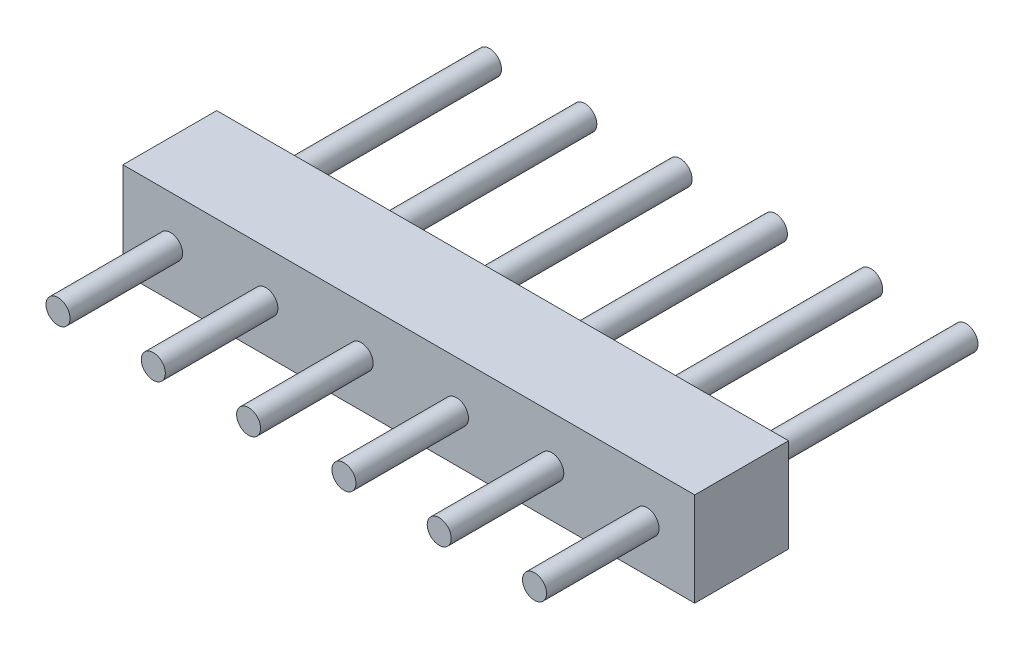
ISO-10303-21;
HEADER;
FILE_DESCRIPTION(('STEP AP214'),'2;1');
FILE_NAME('part.step','',(''),(''),'','','');
FILE_SCHEMA(('AUTOMOTIVE_DESIGN { 1 0 10303 214 1 1 1 1 }'));
ENDSEC;
DATA;
#1=APPLICATION_CONTEXT('core data for automotive mechanical design processes');
#2=APPLICATION_PROTOCOL_DEFINITION('international standard','automotive_design',2000,#1);
#3=PRODUCT_CONTEXT('',#1,'mechanical');
#4=PRODUCT('Part','Part','',(#3));
#5=PRODUCT_RELATED_PRODUCT_CATEGORY('part','',(#4));
#6=PRODUCT_DEFINITION_FORMATION('','',#4);
#7=PRODUCT_DEFINITION_CONTEXT('part definition',#1,'design');
#8=PRODUCT_DEFINITION('design','',#6,#7);
#9=PRODUCT_DEFINITION_SHAPE('','',#8);
#10=(LENGTH_UNIT() NAMED_UNIT(*) SI_UNIT(.MILLI.,.METRE.));
#11=(NAMED_UNIT(*) PLANE_ANGLE_UNIT() SI_UNIT($,.RADIAN.));
#12=(NAMED_UNIT(*) SI_UNIT($,.STERADIAN.) SOLID_ANGLE_UNIT());
#13=UNCERTAINTY_MEASURE_WITH_UNIT(LENGTH_MEASURE(1.E-05),#10,'distance_accuracy_value','');
#14=(GEOMETRIC_REPRESENTATION_CONTEXT(3) GLOBAL_UNCERTAINTY_ASSIGNED_CONTEXT((#13)) GLOBAL_UNIT_ASSIGNED_CONTEXT((#10,
#11,#12)) REPRESENTATION_CONTEXT('',''));
#15=CARTESIAN_POINT('',(0.,0.,0.));
#16=DIRECTION('',(0.,0.,1.));
#17=DIRECTION('',(1.,0.,0.));
#18=AXIS2_PLACEMENT_3D('',#15,#16,#17);
#19=CARTESIAN_POINT('',(0.,0.,2.5));
#20=DIRECTION('',(1.,0.,0.));
#21=DIRECTION('',(0.,0.,-1.));
#22=AXIS2_PLACEMENT_3D('',#19,#20,#21);
#23=PLANE('',#22);
#24=DIRECTION('',(0.,-1.,0.));
#25=VECTOR('',#24,1.);
#26=CARTESIAN_POINT('',(0.,0.,0.));
#27=LINE('',#26,#25);
#28=CARTESIAN_POINT('',(0.,2.5,0.));
#29=VERTEX_POINT('',#28);
#30=CARTESIAN_POINT('',(0.,0.,0.));
#31=VERTEX_POINT('',#30);
#32=EDGE_CURVE('E102',#29,#31,#27,.T.);
#33=ORIENTED_EDGE('',*,*,#32,.T.);
#34=DIRECTION('',(0.,0.,-1.));
#35=VECTOR('',#34,1.);
#36=CARTESIAN_POINT('',(0.,0.,2.5));
#37=LINE('',#36,#35);
#38=CARTESIAN_POINT('',(0.,0.,2.5));
#39=VERTEX_POINT('',#38);
#40=EDGE_CURVE('E93',#39,#31,#37,.T.);
#41=ORIENTED_EDGE('',*,*,#40,.F.);
#42=DIRECTION('',(0.,-1.,0.));
#43=VECTOR('',#42,1.);
#44=CARTESIAN_POINT('',(0.,0.,2.5));
#45=LINE('',#44,#43);
#46=CARTESIAN_POINT('',(0.,2.5,2.5));
#47=VERTEX_POINT('',#46);
#48=EDGE_CURVE('E87',#47,#39,#45,.T.);
#49=ORIENTED_EDGE('',*,*,#48,.F.);
#50=DIRECTION('',(0.,0.,-1.));
#51=VECTOR('',#50,1.);
#52=CARTESIAN_POINT('',(0.,2.5,2.5));
#53=LINE('',#52,#51);
#54=EDGE_CURVE('E98',#47,#29,#53,.T.);
#55=ORIENTED_EDGE('',*,*,#54,.T.);
#56=EDGE_LOOP('',(#33,#41,#49,#55));
#57=FACE_BOUND('',#56,.T.);
#58=ADVANCED_FACE('F35',(#57),#23,.F.);
#59=CARTESIAN_POINT('',(0.,0.,2.5));
#60=DIRECTION('',(0.,1.,0.));
#61=DIRECTION('',(0.,0.,1.));
#62=AXIS2_PLACEMENT_3D('',#59,#60,#61);
#63=PLANE('',#62);
#64=DIRECTION('',(1.,0.,0.));
#65=VECTOR('',#64,1.);
#66=CARTESIAN_POINT('',(0.,0.,0.));
#67=LINE('',#66,#65);
#68=CARTESIAN_POINT('',(15.24,0.,0.));
#69=VERTEX_POINT('',#68);
#70=EDGE_CURVE('E92',#31,#69,#67,.T.);
#71=ORIENTED_EDGE('',*,*,#70,.T.);
#72=DIRECTION('',(0.,0.,-1.));
#73=VECTOR('',#72,1.);
#74=CARTESIAN_POINT('',(15.24,0.,2.5));
#75=LINE('',#74,#73);
#76=CARTESIAN_POINT('',(15.24,0.,2.5));
#77=VERTEX_POINT('',#76);
#78=EDGE_CURVE('E90',#77,#69,#75,.T.);
#79=ORIENTED_EDGE('',*,*,#78,.F.);
#80=DIRECTION('',(1.,0.,0.));
#81=VECTOR('',#80,1.);
#82=CARTESIAN_POINT('',(0.,0.,2.5));
#83=LINE('',#82,#81);
#84=EDGE_CURVE('E82',#39,#77,#83,.T.);
#85=ORIENTED_EDGE('',*,*,#84,.F.);
#86=ORIENTED_EDGE('',*,*,#40,.T.);
#87=EDGE_LOOP('',(#71,#79,#85,#86));
#88=FACE_BOUND('',#87,.T.);
#89=ADVANCED_FACE('F91',(#88),#63,.F.);
#90=CARTESIAN_POINT('',(15.24,0.,2.5));
#91=DIRECTION('',(-1.,0.,0.));
#92=DIRECTION('',(0.,0.,1.));
#93=AXIS2_PLACEMENT_3D('',#90,#91,#92);
#94=PLANE('',#93);
#95=DIRECTION('',(0.,1.,0.));
#96=VECTOR('',#95,1.);
#97=CARTESIAN_POINT('',(15.24,0.,0.));
#98=LINE('',#97,#96);
#99=CARTESIAN_POINT('',(15.24,2.5,0.));
#100=VERTEX_POINT('',#99);
#101=EDGE_CURVE('E68',#69,#100,#98,.T.);
#102=ORIENTED_EDGE('',*,*,#101,.T.);
#103=DIRECTION('',(0.,0.,-1.));
#104=VECTOR('',#103,1.);
#105=CARTESIAN_POINT('',(15.24,2.5,2.5));
#106=LINE('',#105,#104);
#107=CARTESIAN_POINT('',(15.24,2.5,2.5));
#108=VERTEX_POINT('',#107);
#109=EDGE_CURVE('E94',#108,#100,#106,.T.);
#110=ORIENTED_EDGE('',*,*,#109,.F.);
#111=DIRECTION('',(0.,1.,0.));
#112=VECTOR('',#111,1.);
#113=CARTESIAN_POINT('',(15.24,0.,2.5));
#114=LINE('',#113,#112);
#115=EDGE_CURVE('E85',#77,#108,#114,.T.);
#116=ORIENTED_EDGE('',*,*,#115,.F.);
#117=ORIENTED_EDGE('',*,*,#78,.T.);
#118=EDGE_LOOP('',(#102,#110,#116,#117));
#119=FACE_BOUND('',#118,.T.);
#120=ADVANCED_FACE('F96',(#119),#94,.F.);
#121=CARTESIAN_POINT('',(0.,2.5,2.5));
#122=DIRECTION('',(0.,-1.,0.));
#123=DIRECTION('',(0.,0.,-1.));
#124=AXIS2_PLACEMENT_3D('',#121,#122,#123);
#125=PLANE('',#124);
#126=DIRECTION('',(-1.,0.,0.));
#127=VECTOR('',#126,1.);
#128=CARTESIAN_POINT('',(0.,2.5,0.));
#129=LINE('',#128,#127);
#130=EDGE_CURVE('E74',#100,#29,#129,.T.);
#131=ORIENTED_EDGE('',*,*,#130,.T.);
#132=ORIENTED_EDGE('',*,*,#54,.F.);
#133=DIRECTION('',(-1.,0.,0.));
#134=VECTOR('',#133,1.);
#135=CARTESIAN_POINT('',(0.,2.5,2.5));
#136=LINE('',#135,#134);
#137=EDGE_CURVE('E51',#108,#47,#136,.T.);
#138=ORIENTED_EDGE('',*,*,#137,.F.);
#139=ORIENTED_EDGE('',*,*,#109,.T.);
#140=EDGE_LOOP('',(#131,#132,#138,#139));
#141=FACE_BOUND('',#140,.T.);
#142=ADVANCED_FACE('F131',(#141),#125,.F.);
#143=CARTESIAN_POINT('',(0.,0.,2.5));
#144=DIRECTION('',(0.,0.,-1.));
#145=DIRECTION('',(-1.,0.,0.));
#146=AXIS2_PLACEMENT_3D('',#143,#144,#145);
#147=PLANE('',#146);
#148=CARTESIAN_POINT('',(13.97,1.25,2.5));
#149=DIRECTION('',(0.,0.,-1.));
#150=DIRECTION('',(-1.,0.,0.));
#151=AXIS2_PLACEMENT_3D('',#148,#149,#150);
#152=CIRCLE('',#151,0.32);
#153=CARTESIAN_POINT('',(13.65,1.25,2.5));
#154=VERTEX_POINT('',#153);
#155=EDGE_CURVE('E11',#154,#154,#152,.F.);
#156=ORIENTED_EDGE('',*,*,#155,.F.);
#157=EDGE_LOOP('',(#156));
#158=FACE_BOUND('',#157,.T.);
#159=CARTESIAN_POINT('',(11.43,1.25,2.5));
#160=DIRECTION('',(0.,0.,-1.));
#161=DIRECTION('',(-1.,0.,0.));
#162=AXIS2_PLACEMENT_3D('',#159,#160,#161);
#163=CIRCLE('',#162,0.32);
#164=CARTESIAN_POINT('',(11.11,1.25,2.5));
#165=VERTEX_POINT('',#164);
#166=EDGE_CURVE('E43',#165,#165,#163,.F.);
#167=ORIENTED_EDGE('',*,*,#166,.F.);
#168=EDGE_LOOP('',(#167));
#169=FACE_BOUND('',#168,.T.);
#170=CARTESIAN_POINT('',(8.89,1.25,2.5));
#171=DIRECTION('',(0.,0.,-1.));
#172=DIRECTION('',(-1.,0.,0.));
#173=AXIS2_PLACEMENT_3D('',#170,#171,#172);
#174=CIRCLE('',#173,0.32);
#175=CARTESIAN_POINT('',(8.57,1.25,2.5));
#176=VERTEX_POINT('',#175);
#177=EDGE_CURVE('E121',#176,#176,#174,.F.);
#178=ORIENTED_EDGE('',*,*,#177,.F.);
#179=EDGE_LOOP('',(#178));
#180=FACE_BOUND('',#179,.T.);
#181=CARTESIAN_POINT('',(6.35,1.25,2.5));
#182=DIRECTION('',(0.,0.,-1.));
#183=DIRECTION('',(-1.,0.,0.));
#184=AXIS2_PLACEMENT_3D('',#181,#182,#183);
#185=CIRCLE('',#184,0.32);
#186=CARTESIAN_POINT('',(6.03,1.25,2.5));
#187=VERTEX_POINT('',#186);
#188=EDGE_CURVE('E118',#187,#187,#185,.F.);
#189=ORIENTED_EDGE('',*,*,#188,.F.);
#190=EDGE_LOOP('',(#189));
#191=FACE_BOUND('',#190,.T.);
#192=CARTESIAN_POINT('',(3.81,1.25,2.5));
#193=DIRECTION('',(0.,0.,-1.));
#194=DIRECTION('',(-1.,0.,0.));
#195=AXIS2_PLACEMENT_3D('',#192,#193,#194);
#196=CIRCLE('',#195,0.32);
#197=CARTESIAN_POINT('',(3.49,1.25,2.5));
#198=VERTEX_POINT('',#197);
#199=EDGE_CURVE('E115',#198,#198,#196,.F.);
#200=ORIENTED_EDGE('',*,*,#199,.F.);
#201=EDGE_LOOP('',(#200));
#202=FACE_BOUND('',#201,.T.);
#203=CARTESIAN_POINT('',(1.27,1.25,2.5));
#204=DIRECTION('',(0.,0.,-1.));
#205=DIRECTION('',(-1.,0.,0.));
#206=AXIS2_PLACEMENT_3D('',#203,#204,#205);
#207=CIRCLE('',#206,0.32);
#208=CARTESIAN_POINT('',(0.950000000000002,1.25,2.5));
#209=VERTEX_POINT('',#208);
#210=EDGE_CURVE('E112',#209,#209,#207,.F.);
#211=ORIENTED_EDGE('',*,*,#210,.F.);
#212=EDGE_LOOP('',(#211));
#213=FACE_BOUND('',#212,.T.);
#214=ORIENTED_EDGE('',*,*,#48,.T.);
#215=ORIENTED_EDGE('',*,*,#84,.T.);
#216=ORIENTED_EDGE('',*,*,#115,.T.);
#217=ORIENTED_EDGE('',*,*,#137,.T.);
#218=EDGE_LOOP('',(#214,#215,#216,#217));
#219=FACE_BOUND('',#218,.T.);
#220=ADVANCED_FACE('F83',(#158,#169,#180,#191,#202,#213,#219),#147,.F.);
#221=CARTESIAN_POINT('',(0.,0.,0.));
#222=DIRECTION('',(0.,0.,-1.));
#223=DIRECTION('',(-1.,0.,0.));
#224=AXIS2_PLACEMENT_3D('',#221,#222,#223);
#225=PLANE('',#224);
#226=CARTESIAN_POINT('',(13.97,1.25,0.));
#227=DIRECTION('',(0.,0.,-1.));
#228=DIRECTION('',(-1.,0.,0.));
#229=AXIS2_PLACEMENT_3D('',#226,#227,#228);
#230=CIRCLE('',#229,0.32);
#231=CARTESIAN_POINT('',(13.65,1.25,0.));
#232=VERTEX_POINT('',#231);
#233=EDGE_CURVE('E432',#232,#232,#230,.T.);
#234=ORIENTED_EDGE('',*,*,#233,.F.);
#235=EDGE_LOOP('',(#234));
#236=FACE_BOUND('',#235,.T.);
#237=CARTESIAN_POINT('',(11.43,1.25,0.));
#238=DIRECTION('',(0.,0.,-1.));
#239=DIRECTION('',(-1.,0.,0.));
#240=AXIS2_PLACEMENT_3D('',#237,#238,#239);
#241=CIRCLE('',#240,0.32);
#242=CARTESIAN_POINT('',(11.11,1.25,0.));
#243=VERTEX_POINT('',#242);
#244=EDGE_CURVE('E431',#243,#243,#241,.T.);
#245=ORIENTED_EDGE('',*,*,#244,.F.);
#246=EDGE_LOOP('',(#245));
#247=FACE_BOUND('',#246,.T.);
#248=CARTESIAN_POINT('',(8.89,1.25,0.));
#249=DIRECTION('',(0.,0.,-1.));
#250=DIRECTION('',(-1.,0.,0.));
#251=AXIS2_PLACEMENT_3D('',#248,#249,#250);
#252=CIRCLE('',#251,0.32);
#253=CARTESIAN_POINT('',(8.57,1.25,0.));
#254=VERTEX_POINT('',#253);
#255=EDGE_CURVE('E441',#254,#254,#252,.T.);
#256=ORIENTED_EDGE('',*,*,#255,.F.);
#257=EDGE_LOOP('',(#256));
#258=FACE_BOUND('',#257,.T.);
#259=CARTESIAN_POINT('',(6.35,1.25,0.));
#260=DIRECTION('',(0.,0.,-1.));
#261=DIRECTION('',(-1.,0.,0.));
#262=AXIS2_PLACEMENT_3D('',#259,#260,#261);
#263=CIRCLE('',#262,0.32);
#264=CARTESIAN_POINT('',(6.03,1.25,0.));
#265=VERTEX_POINT('',#264);
#266=EDGE_CURVE('E446',#265,#265,#263,.T.);
#267=ORIENTED_EDGE('',*,*,#266,.F.);
#268=EDGE_LOOP('',(#267));
#269=FACE_BOUND('',#268,.T.);
#270=CARTESIAN_POINT('',(3.81,1.25,0.));
#271=DIRECTION('',(0.,0.,-1.));
#272=DIRECTION('',(-1.,0.,0.));
#273=AXIS2_PLACEMENT_3D('',#270,#271,#272);
#274=CIRCLE('',#273,0.32);
#275=CARTESIAN_POINT('',(3.49,1.25,0.));
#276=VERTEX_POINT('',#275);
#277=EDGE_CURVE('E452',#276,#276,#274,.T.);
#278=ORIENTED_EDGE('',*,*,#277,.F.);
#279=EDGE_LOOP('',(#278));
#280=FACE_BOUND('',#279,.T.);
#281=CARTESIAN_POINT('',(1.27,1.25,0.));
#282=DIRECTION('',(0.,0.,-1.));
#283=DIRECTION('',(-1.,0.,0.));
#284=AXIS2_PLACEMENT_3D('',#281,#282,#283);
#285=CIRCLE('',#284,0.32);
#286=CARTESIAN_POINT('',(0.950000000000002,1.25,0.));
#287=VERTEX_POINT('',#286);
#288=EDGE_CURVE('E458',#287,#287,#285,.T.);
#289=ORIENTED_EDGE('',*,*,#288,.F.);
#290=EDGE_LOOP('',(#289));
#291=FACE_BOUND('',#290,.T.);
#292=ORIENTED_EDGE('',*,*,#32,.F.);
#293=ORIENTED_EDGE('',*,*,#130,.F.);
#294=ORIENTED_EDGE('',*,*,#101,.F.);
#295=ORIENTED_EDGE('',*,*,#70,.F.);
#296=EDGE_LOOP('',(#292,#293,#294,#295));
#297=FACE_BOUND('',#296,.T.);
#298=ADVANCED_FACE('F130',(#236,#247,#258,#269,#280,#291,#297),#225,.T.);
#299=CARTESIAN_POINT('',(1.27,1.25,5.5));
#300=DIRECTION('',(0.,0.,-1.));
#301=DIRECTION('',(-1.,0.,0.));
#302=AXIS2_PLACEMENT_3D('',#299,#300,#301);
#303=CYLINDRICAL_SURFACE('',#302,0.32);
#304=CARTESIAN_POINT('',(1.27,1.25,5.5));
#305=DIRECTION('',(0.,0.,1.));
#306=DIRECTION('',(1.,0.,0.));
#307=AXIS2_PLACEMENT_3D('',#304,#305,#306);
#308=CIRCLE('',#307,0.32);
#309=CARTESIAN_POINT('',(1.59,1.25,5.5));
#310=VERTEX_POINT('',#309);
#311=EDGE_CURVE('E105',#310,#310,#308,.T.);
#312=ORIENTED_EDGE('',*,*,#311,.F.);
#313=EDGE_LOOP('',(#312));
#314=FACE_BOUND('',#313,.T.);
#315=ORIENTED_EDGE('',*,*,#210,.T.);
#316=EDGE_LOOP('',(#315));
#317=FACE_BOUND('',#316,.T.);
#318=ADVANCED_FACE('F142',(#314,#317),#303,.T.);
#319=CARTESIAN_POINT('',(1.27,1.25,5.5));
#320=DIRECTION('',(0.,0.,1.));
#321=DIRECTION('',(1.,0.,0.));
#322=AXIS2_PLACEMENT_3D('',#319,#320,#321);
#323=PLANE('',#322);
#324=ORIENTED_EDGE('',*,*,#311,.T.);
#325=EDGE_LOOP('',(#324));
#326=FACE_BOUND('',#325,.T.);
#327=ADVANCED_FACE('F144',(#326),#323,.T.);
#328=CARTESIAN_POINT('',(3.81,1.25,5.5));
#329=DIRECTION('',(0.,0.,-1.));
#330=DIRECTION('',(-1.,0.,0.));
#331=AXIS2_PLACEMENT_3D('',#328,#329,#330);
#332=CYLINDRICAL_SURFACE('',#331,0.32);
#333=CARTESIAN_POINT('',(3.81,1.25,5.5));
#334=DIRECTION('',(0.,0.,1.));
#335=DIRECTION('',(1.,0.,0.));
#336=AXIS2_PLACEMENT_3D('',#333,#334,#335);
#337=CIRCLE('',#336,0.32);
#338=CARTESIAN_POINT('',(4.13,1.25,5.5));
#339=VERTEX_POINT('',#338);
#340=EDGE_CURVE('E478',#339,#339,#337,.T.);
#341=ORIENTED_EDGE('',*,*,#340,.F.);
#342=EDGE_LOOP('',(#341));
#343=FACE_BOUND('',#342,.T.);
#344=ORIENTED_EDGE('',*,*,#199,.T.);
#345=EDGE_LOOP('',(#344));
#346=FACE_BOUND('',#345,.T.);
#347=ADVANCED_FACE('F151',(#343,#346),#332,.T.);
#348=CARTESIAN_POINT('',(3.81,1.25,5.5));
#349=DIRECTION('',(0.,0.,1.));
#350=DIRECTION('',(1.,0.,0.));
#351=AXIS2_PLACEMENT_3D('',#348,#349,#350);
#352=PLANE('',#351);
#353=ORIENTED_EDGE('',*,*,#340,.T.);
#354=EDGE_LOOP('',(#353));
#355=FACE_BOUND('',#354,.T.);
#356=ADVANCED_FACE('F217',(#355),#352,.T.);
#357=CARTESIAN_POINT('',(6.35,1.25,5.5));
#358=DIRECTION('',(0.,0.,-1.));
#359=DIRECTION('',(-1.,0.,0.));
#360=AXIS2_PLACEMENT_3D('',#357,#358,#359);
#361=CYLINDRICAL_SURFACE('',#360,0.32);
#362=CARTESIAN_POINT('',(6.35,1.25,5.5));
#363=DIRECTION('',(0.,0.,1.));
#364=DIRECTION('',(1.,0.,0.));
#365=AXIS2_PLACEMENT_3D('',#362,#363,#364);
#366=CIRCLE('',#365,0.32);
#367=CARTESIAN_POINT('',(6.67,1.25,5.5));
#368=VERTEX_POINT('',#367);
#369=EDGE_CURVE('E475',#368,#368,#366,.T.);
#370=ORIENTED_EDGE('',*,*,#369,.F.);
#371=EDGE_LOOP('',(#370));
#372=FACE_BOUND('',#371,.T.);
#373=ORIENTED_EDGE('',*,*,#188,.T.);
#374=EDGE_LOOP('',(#373));
#375=FACE_BOUND('',#374,.T.);
#376=ADVANCED_FACE('F226',(#372,#375),#361,.T.);
#377=CARTESIAN_POINT('',(6.35,1.25,5.5));
#378=DIRECTION('',(0.,0.,1.));
#379=DIRECTION('',(1.,0.,0.));
#380=AXIS2_PLACEMENT_3D('',#377,#378,#379);
#381=PLANE('',#380);
#382=ORIENTED_EDGE('',*,*,#369,.T.);
#383=EDGE_LOOP('',(#382));
#384=FACE_BOUND('',#383,.T.);
#385=ADVANCED_FACE('F235',(#384),#381,.T.);
#386=CARTESIAN_POINT('',(8.89,1.25,5.5));
#387=DIRECTION('',(0.,0.,-1.));
#388=DIRECTION('',(-1.,0.,0.));
#389=AXIS2_PLACEMENT_3D('',#386,#387,#388);
#390=CYLINDRICAL_SURFACE('',#389,0.32);
#391=CARTESIAN_POINT('',(8.89,1.25,5.5));
#392=DIRECTION('',(0.,0.,1.));
#393=DIRECTION('',(1.,0.,0.));
#394=AXIS2_PLACEMENT_3D('',#391,#392,#393);
#395=CIRCLE('',#394,0.32);
#396=CARTESIAN_POINT('',(9.21,1.25,5.5));
#397=VERTEX_POINT('',#396);
#398=EDGE_CURVE('E472',#397,#397,#395,.T.);
#399=ORIENTED_EDGE('',*,*,#398,.F.);
#400=EDGE_LOOP('',(#399));
#401=FACE_BOUND('',#400,.T.);
#402=ORIENTED_EDGE('',*,*,#177,.T.);
#403=EDGE_LOOP('',(#402));
#404=FACE_BOUND('',#403,.T.);
#405=ADVANCED_FACE('F244',(#401,#404),#390,.T.);
#406=CARTESIAN_POINT('',(8.89,1.25,5.5));
#407=DIRECTION('',(0.,0.,1.));
#408=DIRECTION('',(1.,0.,0.));
#409=AXIS2_PLACEMENT_3D('',#406,#407,#408);
#410=PLANE('',#409);
#411=ORIENTED_EDGE('',*,*,#398,.T.);
#412=EDGE_LOOP('',(#411));
#413=FACE_BOUND('',#412,.T.);
#414=ADVANCED_FACE('F253',(#413),#410,.T.);
#415=CARTESIAN_POINT('',(11.43,1.25,5.5));
#416=DIRECTION('',(0.,0.,-1.));
#417=DIRECTION('',(-1.,0.,0.));
#418=AXIS2_PLACEMENT_3D('',#415,#416,#417);
#419=CYLINDRICAL_SURFACE('',#418,0.32);
#420=CARTESIAN_POINT('',(11.43,1.25,5.5));
#421=DIRECTION('',(0.,0.,1.));
#422=DIRECTION('',(1.,0.,0.));
#423=AXIS2_PLACEMENT_3D('',#420,#421,#422);
#424=CIRCLE('',#423,0.32);
#425=CARTESIAN_POINT('',(11.75,1.25,5.5));
#426=VERTEX_POINT('',#425);
#427=EDGE_CURVE('E469',#426,#426,#424,.T.);
#428=ORIENTED_EDGE('',*,*,#427,.F.);
#429=EDGE_LOOP('',(#428));
#430=FACE_BOUND('',#429,.T.);
#431=ORIENTED_EDGE('',*,*,#166,.T.);
#432=EDGE_LOOP('',(#431));
#433=FACE_BOUND('',#432,.T.);
#434=ADVANCED_FACE('F126',(#430,#433),#419,.T.);
#435=CARTESIAN_POINT('',(11.43,1.25,5.5));
#436=DIRECTION('',(0.,0.,1.));
#437=DIRECTION('',(1.,0.,0.));
#438=AXIS2_PLACEMENT_3D('',#435,#436,#437);
#439=PLANE('',#438);
#440=ORIENTED_EDGE('',*,*,#427,.T.);
#441=EDGE_LOOP('',(#440));
#442=FACE_BOUND('',#441,.T.);
#443=ADVANCED_FACE('F270',(#442),#439,.T.);
#444=CARTESIAN_POINT('',(13.97,1.25,5.5));
#445=DIRECTION('',(0.,0.,-1.));
#446=DIRECTION('',(-1.,0.,0.));
#447=AXIS2_PLACEMENT_3D('',#444,#445,#446);
#448=CYLINDRICAL_SURFACE('',#447,0.32);
#449=CARTESIAN_POINT('',(13.97,1.25,5.5));
#450=DIRECTION('',(0.,0.,1.));
#451=DIRECTION('',(1.,0.,0.));
#452=AXIS2_PLACEMENT_3D('',#449,#450,#451);
#453=CIRCLE('',#452,0.32);
#454=CARTESIAN_POINT('',(14.29,1.25,5.5));
#455=VERTEX_POINT('',#454);
#456=EDGE_CURVE('E464',#455,#455,#453,.T.);
#457=ORIENTED_EDGE('',*,*,#456,.F.);
#458=EDGE_LOOP('',(#457));
#459=FACE_BOUND('',#458,.T.);
#460=ORIENTED_EDGE('',*,*,#155,.T.);
#461=EDGE_LOOP('',(#460));
#462=FACE_BOUND('',#461,.T.);
#463=ADVANCED_FACE('F279',(#459,#462),#448,.T.);
#464=CARTESIAN_POINT('',(13.97,1.25,5.5));
#465=DIRECTION('',(0.,0.,1.));
#466=DIRECTION('',(1.,0.,0.));
#467=AXIS2_PLACEMENT_3D('',#464,#465,#466);
#468=PLANE('',#467);
#469=ORIENTED_EDGE('',*,*,#456,.T.);
#470=EDGE_LOOP('',(#469));
#471=FACE_BOUND('',#470,.T.);
#472=ADVANCED_FACE('F288',(#471),#468,.T.);
#473=CARTESIAN_POINT('',(1.27,1.25,-6.));
#474=DIRECTION('',(0.,0.,1.));
#475=DIRECTION('',(1.,0.,0.));
#476=AXIS2_PLACEMENT_3D('',#473,#474,#475);
#477=CYLINDRICAL_SURFACE('',#476,0.32);
#478=CARTESIAN_POINT('',(1.27,1.25,-6.));
#479=DIRECTION('',(0.,0.,-1.));
#480=DIRECTION('',(-1.,0.,0.));
#481=AXIS2_PLACEMENT_3D('',#478,#479,#480);
#482=CIRCLE('',#481,0.32);
#483=CARTESIAN_POINT('',(0.950000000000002,1.25,-6.));
#484=VERTEX_POINT('',#483);
#485=EDGE_CURVE('E461',#484,#484,#482,.T.);
#486=ORIENTED_EDGE('',*,*,#485,.F.);
#487=EDGE_LOOP('',(#486));
#488=FACE_BOUND('',#487,.T.);
#489=ORIENTED_EDGE('',*,*,#288,.T.);
#490=EDGE_LOOP('',(#489));
#491=FACE_BOUND('',#490,.T.);
#492=ADVANCED_FACE('F296',(#488,#491),#477,.T.);
#493=CARTESIAN_POINT('',(1.27,1.25,-6.));
#494=DIRECTION('',(0.,0.,-1.));
#495=DIRECTION('',(-1.,0.,0.));
#496=AXIS2_PLACEMENT_3D('',#493,#494,#495);
#497=PLANE('',#496);
#498=ORIENTED_EDGE('',*,*,#485,.T.);
#499=EDGE_LOOP('',(#498));
#500=FACE_BOUND('',#499,.T.);
#501=ADVANCED_FACE('F304',(#500),#497,.T.);
#502=CARTESIAN_POINT('',(3.81,1.25,-6.));
#503=DIRECTION('',(0.,0.,1.));
#504=DIRECTION('',(1.,0.,0.));
#505=AXIS2_PLACEMENT_3D('',#502,#503,#504);
#506=CYLINDRICAL_SURFACE('',#505,0.32);
#507=CARTESIAN_POINT('',(3.81,1.25,-6.));
#508=DIRECTION('',(0.,0.,-1.));
#509=DIRECTION('',(-1.,0.,0.));
#510=AXIS2_PLACEMENT_3D('',#507,#508,#509);
#511=CIRCLE('',#510,0.32);
#512=CARTESIAN_POINT('',(3.49,1.25,-6.));
#513=VERTEX_POINT('',#512);
#514=EDGE_CURVE('E455',#513,#513,#511,.T.);
#515=ORIENTED_EDGE('',*,*,#514,.F.);
#516=EDGE_LOOP('',(#515));
#517=FACE_BOUND('',#516,.T.);
#518=ORIENTED_EDGE('',*,*,#277,.T.);
#519=EDGE_LOOP('',(#518));
#520=FACE_BOUND('',#519,.T.);
#521=ADVANCED_FACE('F313',(#517,#520),#506,.T.);
#522=CARTESIAN_POINT('',(3.81,1.25,-6.));
#523=DIRECTION('',(0.,0.,-1.));
#524=DIRECTION('',(-1.,0.,0.));
#525=AXIS2_PLACEMENT_3D('',#522,#523,#524);
#526=PLANE('',#525);
#527=ORIENTED_EDGE('',*,*,#514,.T.);
#528=EDGE_LOOP('',(#527));
#529=FACE_BOUND('',#528,.T.);
#530=ADVANCED_FACE('F322',(#529),#526,.T.);
#531=CARTESIAN_POINT('',(6.35,1.25,-6.));
#532=DIRECTION('',(0.,0.,1.));
#533=DIRECTION('',(1.,0.,0.));
#534=AXIS2_PLACEMENT_3D('',#531,#532,#533);
#535=CYLINDRICAL_SURFACE('',#534,0.32);
#536=CARTESIAN_POINT('',(6.35,1.25,-6.));
#537=DIRECTION('',(0.,0.,-1.));
#538=DIRECTION('',(-1.,0.,0.));
#539=AXIS2_PLACEMENT_3D('',#536,#537,#538);
#540=CIRCLE('',#539,0.32);
#541=CARTESIAN_POINT('',(6.03,1.25,-6.));
#542=VERTEX_POINT('',#541);
#543=EDGE_CURVE('E449',#542,#542,#540,.T.);
#544=ORIENTED_EDGE('',*,*,#543,.F.);
#545=EDGE_LOOP('',(#544));
#546=FACE_BOUND('',#545,.T.);
#547=ORIENTED_EDGE('',*,*,#266,.T.);
#548=EDGE_LOOP('',(#547));
#549=FACE_BOUND('',#548,.T.);
#550=ADVANCED_FACE('F331',(#546,#549),#535,.T.);
#551=CARTESIAN_POINT('',(6.35,1.25,-6.));
#552=DIRECTION('',(0.,0.,-1.));
#553=DIRECTION('',(-1.,0.,0.));
#554=AXIS2_PLACEMENT_3D('',#551,#552,#553);
#555=PLANE('',#554);
#556=ORIENTED_EDGE('',*,*,#543,.T.);
#557=EDGE_LOOP('',(#556));
#558=FACE_BOUND('',#557,.T.);
#559=ADVANCED_FACE('F340',(#558),#555,.T.);
#560=CARTESIAN_POINT('',(8.89,1.25,-6.));
#561=DIRECTION('',(0.,0.,1.));
#562=DIRECTION('',(1.,0.,0.));
#563=AXIS2_PLACEMENT_3D('',#560,#561,#562);
#564=CYLINDRICAL_SURFACE('',#563,0.32);
#565=CARTESIAN_POINT('',(8.89,1.25,-6.));
#566=DIRECTION('',(0.,0.,-1.));
#567=DIRECTION('',(-1.,0.,0.));
#568=AXIS2_PLACEMENT_3D('',#565,#566,#567);
#569=CIRCLE('',#568,0.32);
#570=CARTESIAN_POINT('',(8.57,1.25,-6.));
#571=VERTEX_POINT('',#570);
#572=EDGE_CURVE('E443',#571,#571,#569,.T.);
#573=ORIENTED_EDGE('',*,*,#572,.F.);
#574=EDGE_LOOP('',(#573));
#575=FACE_BOUND('',#574,.T.);
#576=ORIENTED_EDGE('',*,*,#255,.T.);
#577=EDGE_LOOP('',(#576));
#578=FACE_BOUND('',#577,.T.);
#579=ADVANCED_FACE('F349',(#575,#578),#564,.T.);
#580=CARTESIAN_POINT('',(8.89,1.25,-6.));
#581=DIRECTION('',(0.,0.,-1.));
#582=DIRECTION('',(-1.,0.,0.));
#583=AXIS2_PLACEMENT_3D('',#580,#581,#582);
#584=PLANE('',#583);
#585=ORIENTED_EDGE('',*,*,#572,.T.);
#586=EDGE_LOOP('',(#585));
#587=FACE_BOUND('',#586,.T.);
#588=ADVANCED_FACE('F358',(#587),#584,.T.);
#589=CARTESIAN_POINT('',(11.43,1.25,-6.));
#590=DIRECTION('',(0.,0.,1.));
#591=DIRECTION('',(1.,0.,0.));
#592=AXIS2_PLACEMENT_3D('',#589,#590,#591);
#593=CYLINDRICAL_SURFACE('',#592,0.32);
#594=CARTESIAN_POINT('',(11.43,1.25,-6.));
#595=DIRECTION('',(0.,0.,-1.));
#596=DIRECTION('',(-1.,0.,0.));
#597=AXIS2_PLACEMENT_3D('',#594,#595,#596);
#598=CIRCLE('',#597,0.32);
#599=CARTESIAN_POINT('',(11.11,1.25,-6.));
#600=VERTEX_POINT('',#599);
#601=EDGE_CURVE('E435',#600,#600,#598,.T.);
#602=ORIENTED_EDGE('',*,*,#601,.F.);
#603=EDGE_LOOP('',(#602));
#604=FACE_BOUND('',#603,.T.);
#605=ORIENTED_EDGE('',*,*,#244,.T.);
#606=EDGE_LOOP('',(#605));
#607=FACE_BOUND('',#606,.T.);
#608=ADVANCED_FACE('F367',(#604,#607),#593,.T.);
#609=CARTESIAN_POINT('',(11.43,1.25,-6.));
#610=DIRECTION('',(0.,0.,-1.));
#611=DIRECTION('',(-1.,0.,0.));
#612=AXIS2_PLACEMENT_3D('',#609,#610,#611);
#613=PLANE('',#612);
#614=ORIENTED_EDGE('',*,*,#601,.T.);
#615=EDGE_LOOP('',(#614));
#616=FACE_BOUND('',#615,.T.);
#617=ADVANCED_FACE('F376',(#616),#613,.T.);
#618=CARTESIAN_POINT('',(13.97,1.25,-6.));
#619=DIRECTION('',(0.,0.,1.));
#620=DIRECTION('',(1.,0.,0.));
#621=AXIS2_PLACEMENT_3D('',#618,#619,#620);
#622=CYLINDRICAL_SURFACE('',#621,0.32);
#623=CARTESIAN_POINT('',(13.97,1.25,-6.));
#624=DIRECTION('',(0.,0.,-1.));
#625=DIRECTION('',(-1.,0.,0.));
#626=AXIS2_PLACEMENT_3D('',#623,#624,#625);
#627=CIRCLE('',#626,0.32);
#628=CARTESIAN_POINT('',(13.65,1.25,-6.));
#629=VERTEX_POINT('',#628);
#630=EDGE_CURVE('E430',#629,#629,#627,.T.);
#631=ORIENTED_EDGE('',*,*,#630,.F.);
#632=EDGE_LOOP('',(#631));
#633=FACE_BOUND('',#632,.T.);
#634=ORIENTED_EDGE('',*,*,#233,.T.);
#635=EDGE_LOOP('',(#634));
#636=FACE_BOUND('',#635,.T.);
#637=ADVANCED_FACE('F385',(#633,#636),#622,.T.);
#638=CARTESIAN_POINT('',(13.97,1.25,-6.));
#639=DIRECTION('',(0.,0.,-1.));
#640=DIRECTION('',(-1.,0.,0.));
#641=AXIS2_PLACEMENT_3D('',#638,#639,#640);
#642=PLANE('',#641);
#643=ORIENTED_EDGE('',*,*,#630,.T.);
#644=EDGE_LOOP('',(#643));
#645=FACE_BOUND('',#644,.T.);
#646=ADVANCED_FACE('F394',(#645),#642,.T.);
#647=CLOSED_SHELL('',(#58,#89,#120,#142,#220,#298,#318,#327,#347,#356,#376,#385,#405,#414,#434,
#443,#463,#472,#492,#501,#521,#530,#550,#559,#579,#588,#608,#617,#637,#646));
#648=MANIFOLD_SOLID_BREP('B2',#647);
#649=ADVANCED_BREP_SHAPE_REPRESENTATION('',(#18,#648),#14);
#650=SHAPE_DEFINITION_REPRESENTATION(#9,#649);
ENDSEC;
END-ISO-10303-21;
